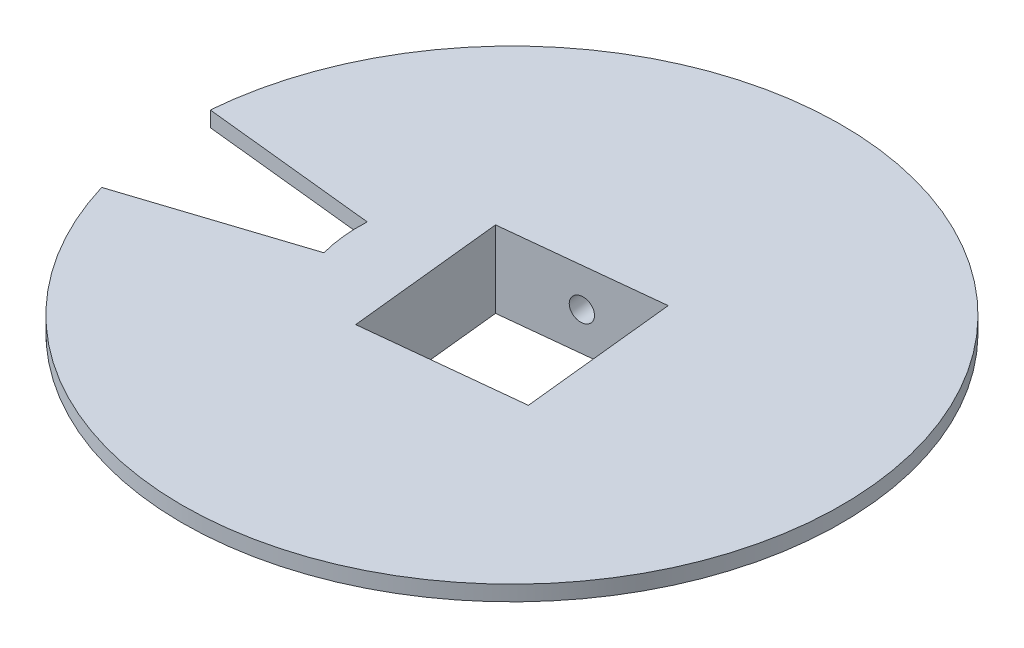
ISO-10303-21;
HEADER;
FILE_DESCRIPTION(('STEP AP214'),'2;1');
FILE_NAME('part.step','',(''),(''),'','','');
FILE_SCHEMA(('AUTOMOTIVE_DESIGN { 1 0 10303 214 1 1 1 1 }'));
ENDSEC;
DATA;
#1=APPLICATION_CONTEXT('core data for automotive mechanical design processes');
#2=APPLICATION_PROTOCOL_DEFINITION('international standard','automotive_design',2000,#1);
#3=PRODUCT_CONTEXT('',#1,'mechanical');
#4=PRODUCT('Part','Part','',(#3));
#5=PRODUCT_RELATED_PRODUCT_CATEGORY('part','',(#4));
#6=PRODUCT_DEFINITION_FORMATION('','',#4);
#7=PRODUCT_DEFINITION_CONTEXT('part definition',#1,'design');
#8=PRODUCT_DEFINITION('design','',#6,#7);
#9=PRODUCT_DEFINITION_SHAPE('','',#8);
#10=(LENGTH_UNIT() NAMED_UNIT(*) SI_UNIT(.MILLI.,.METRE.));
#11=(NAMED_UNIT(*) PLANE_ANGLE_UNIT() SI_UNIT($,.RADIAN.));
#12=(NAMED_UNIT(*) SI_UNIT($,.STERADIAN.) SOLID_ANGLE_UNIT());
#13=UNCERTAINTY_MEASURE_WITH_UNIT(LENGTH_MEASURE(1.E-05),#10,'distance_accuracy_value','');
#14=(GEOMETRIC_REPRESENTATION_CONTEXT(3) GLOBAL_UNCERTAINTY_ASSIGNED_CONTEXT((#13)) GLOBAL_UNIT_ASSIGNED_CONTEXT((#10,
#11,#12)) REPRESENTATION_CONTEXT('',''));
#15=CARTESIAN_POINT('',(0.,0.,0.));
#16=DIRECTION('',(0.,0.,1.));
#17=DIRECTION('',(1.,0.,0.));
#18=AXIS2_PLACEMENT_3D('',#15,#16,#17);
#19=CARTESIAN_POINT('',(0.,-4.,0.));
#20=DIRECTION('',(0.,-1.,0.));
#21=DIRECTION('',(1.,0.,0.));
#22=AXIS2_PLACEMENT_3D('',#19,#20,#21);
#23=PLANE('',#22);
#24=DIRECTION('',(-0.994521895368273,0.,-0.104528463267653));
#25=VECTOR('',#24,1.);
#26=CARTESIAN_POINT('',(-0.209056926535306,-4.00000000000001,1.98904379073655));
#27=LINE('',#26,#25);
#28=CARTESIAN_POINT('',(-39.9401755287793,-4.00000000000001,-2.18686504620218));
#29=VERTEX_POINT('',#28);
#30=CARTESIAN_POINT('',(-85.7148083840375,-4.00000000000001,-6.99797282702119));
#31=VERTEX_POINT('',#30);
#32=EDGE_CURVE('E149',#29,#31,#27,.T.);
#33=ORIENTED_EDGE('',*,*,#32,.T.);
#34=CARTESIAN_POINT('',(0.,-4.,0.));
#35=DIRECTION('',(0.,1.,0.));
#36=DIRECTION('',(-1.,0.,0.));
#37=AXIS2_PLACEMENT_3D('',#34,#35,#36);
#38=CIRCLE('',#37,86.);
#39=CARTESIAN_POINT('',(-82.3867738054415,-4.00000000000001,24.6661610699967));
#40=VERTEX_POINT('',#39);
#41=EDGE_CURVE('E168',#40,#31,#38,.T.);
#42=ORIENTED_EDGE('',*,*,#41,.F.);
#43=DIRECTION('',(-0.951056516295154,0.,0.309016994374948));
#44=VECTOR('',#43,1.);
#45=CARTESIAN_POINT('',(-0.618033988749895,-4.00000000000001,-1.90211303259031));
#46=LINE('',#45,#44);
#47=CARTESIAN_POINT('',(-38.6127120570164,-4.00000000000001,10.4431062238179));
#48=VERTEX_POINT('',#47);
#49=EDGE_CURVE('E152',#48,#40,#46,.T.);
#50=ORIENTED_EDGE('',*,*,#49,.F.);
#51=CARTESIAN_POINT('',(0.,-4.00000000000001,0.));
#52=DIRECTION('',(0.,1.,0.));
#53=DIRECTION('',(0.,0.,1.));
#54=AXIS2_PLACEMENT_3D('',#51,#52,#53);
#55=CIRCLE('',#54,40.);
#56=EDGE_CURVE('E163',#48,#29,#55,.T.);
#57=ORIENTED_EDGE('',*,*,#56,.T.);
#58=EDGE_LOOP('',(#33,#42,#50,#57));
#59=FACE_BOUND('',#58,.T.);
#60=ADVANCED_FACE('F34',(#59),#23,.T.);
#61=CARTESIAN_POINT('',(0.,0.,0.));
#62=DIRECTION('',(0.,1.,0.));
#63=DIRECTION('',(-1.,0.,0.));
#64=AXIS2_PLACEMENT_3D('',#61,#62,#63);
#65=CYLINDRICAL_SURFACE('',#64,86.);
#66=DIRECTION('',(0.,1.,0.));
#67=VECTOR('',#66,1.);
#68=CARTESIAN_POINT('',(-85.7148083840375,0.,-6.99797282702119));
#69=LINE('',#68,#67);
#70=CARTESIAN_POINT('',(-85.7148083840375,0.,-6.99797282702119));
#71=VERTEX_POINT('',#70);
#72=EDGE_CURVE('E161',#71,#31,#69,.F.);
#73=ORIENTED_EDGE('',*,*,#72,.F.);
#74=CARTESIAN_POINT('',(0.,0.,0.));
#75=DIRECTION('',(0.,1.,0.));
#76=DIRECTION('',(-1.,0.,0.));
#77=AXIS2_PLACEMENT_3D('',#74,#75,#76);
#78=CIRCLE('',#77,86.);
#79=CARTESIAN_POINT('',(-82.3867738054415,0.,24.6661610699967));
#80=VERTEX_POINT('',#79);
#81=EDGE_CURVE('E165',#80,#71,#78,.T.);
#82=ORIENTED_EDGE('',*,*,#81,.F.);
#83=DIRECTION('',(0.,1.,0.));
#84=VECTOR('',#83,1.);
#85=CARTESIAN_POINT('',(-82.3867738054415,0.,24.6661610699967));
#86=LINE('',#85,#84);
#87=EDGE_CURVE('E155',#80,#40,#86,.F.);
#88=ORIENTED_EDGE('',*,*,#87,.T.);
#89=ORIENTED_EDGE('',*,*,#41,.T.);
#90=EDGE_LOOP('',(#73,#82,#88,#89));
#91=FACE_BOUND('',#90,.T.);
#92=ADVANCED_FACE('F191',(#91),#65,.T.);
#93=CARTESIAN_POINT('',(0.,0.,0.));
#94=DIRECTION('',(0.,1.,0.));
#95=DIRECTION('',(-1.,0.,0.));
#96=AXIS2_PLACEMENT_3D('',#93,#94,#95);
#97=PLANE('',#96);
#98=DIRECTION('',(0.994521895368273,0.,-0.104528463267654));
#99=VECTOR('',#98,1.);
#100=CARTESIAN_POINT('',(2.14283349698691,0.,20.3876988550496));
#101=LINE('',#100,#99);
#102=CARTESIAN_POINT('',(-18.2448653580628,0.,22.5305323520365));
#103=VERTEX_POINT('',#102);
#104=CARTESIAN_POINT('',(22.5305323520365,0.,18.2448653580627));
#105=VERTEX_POINT('',#104);
#106=EDGE_CURVE('E49',#103,#105,#101,.T.);
#107=ORIENTED_EDGE('',*,*,#106,.F.);
#108=DIRECTION('',(0.104528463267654,0.,0.994521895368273));
#109=VECTOR('',#108,1.);
#110=CARTESIAN_POINT('',(-20.3876988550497,0.,2.14283349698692));
#111=LINE('',#110,#109);
#112=CARTESIAN_POINT('',(-22.5305323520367,0.,-18.2448653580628));
#113=VERTEX_POINT('',#112);
#114=EDGE_CURVE('E117',#113,#103,#111,.T.);
#115=ORIENTED_EDGE('',*,*,#114,.F.);
#116=DIRECTION('',(-0.994521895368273,0.,0.104528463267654));
#117=VECTOR('',#116,1.);
#118=CARTESIAN_POINT('',(-2.14283349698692,0.,-20.3876988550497));
#119=LINE('',#118,#117);
#120=CARTESIAN_POINT('',(18.2448653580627,0.,-22.5305323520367));
#121=VERTEX_POINT('',#120);
#122=EDGE_CURVE('E120',#121,#113,#119,.T.);
#123=ORIENTED_EDGE('',*,*,#122,.F.);
#124=DIRECTION('',(-0.104528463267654,0.,-0.994521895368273));
#125=VECTOR('',#124,1.);
#126=CARTESIAN_POINT('',(20.3876988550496,0.,-2.14283349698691));
#127=LINE('',#126,#125);
#128=EDGE_CURVE('E133',#105,#121,#127,.T.);
#129=ORIENTED_EDGE('',*,*,#128,.F.);
#130=EDGE_LOOP('',(#107,#115,#123,#129));
#131=FACE_BOUND('',#130,.T.);
#132=DIRECTION('',(-0.994521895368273,0.,-0.104528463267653));
#133=VECTOR('',#132,1.);
#134=CARTESIAN_POINT('',(-0.209056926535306,0.,1.98904379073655));
#135=LINE('',#134,#133);
#136=CARTESIAN_POINT('',(-39.9401755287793,0.,-2.18686504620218));
#137=VERTEX_POINT('',#136);
#138=EDGE_CURVE('E146',#137,#71,#135,.T.);
#139=ORIENTED_EDGE('',*,*,#138,.F.);
#140=CARTESIAN_POINT('',(0.,0.,0.));
#141=DIRECTION('',(0.,-1.,0.));
#142=DIRECTION('',(1.,0.,0.));
#143=AXIS2_PLACEMENT_3D('',#140,#141,#142);
#144=CIRCLE('',#143,40.);
#145=CARTESIAN_POINT('',(-38.6127120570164,0.,10.4431062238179));
#146=VERTEX_POINT('',#145);
#147=EDGE_CURVE('E139',#146,#137,#144,.T.);
#148=ORIENTED_EDGE('',*,*,#147,.F.);
#149=DIRECTION('',(-0.951056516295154,0.,0.309016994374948));
#150=VECTOR('',#149,1.);
#151=CARTESIAN_POINT('',(-0.618033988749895,0.,-1.90211303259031));
#152=LINE('',#151,#150);
#153=EDGE_CURVE('E153',#146,#80,#152,.T.);
#154=ORIENTED_EDGE('',*,*,#153,.T.);
#155=ORIENTED_EDGE('',*,*,#81,.T.);
#156=EDGE_LOOP('',(#139,#148,#154,#155));
#157=FACE_BOUND('',#156,.T.);
#158=ADVANCED_FACE('F188',(#131,#157),#97,.T.);
#159=CARTESIAN_POINT('',(-0.618033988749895,-4.00000000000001,-1.90211303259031));
#160=DIRECTION('',(-0.309016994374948,0.,-0.951056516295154));
#161=DIRECTION('',(-0.951056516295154,0.,0.309016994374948));
#162=AXIS2_PLACEMENT_3D('',#159,#160,#161);
#163=PLANE('',#162);
#164=ORIENTED_EDGE('',*,*,#153,.F.);
#165=DIRECTION('',(0.,1.,0.));
#166=VECTOR('',#165,1.);
#167=CARTESIAN_POINT('',(-38.6127120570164,-4.00000000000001,10.4431062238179));
#168=LINE('',#167,#166);
#169=EDGE_CURVE('E42',#146,#48,#168,.F.);
#170=ORIENTED_EDGE('',*,*,#169,.T.);
#171=ORIENTED_EDGE('',*,*,#49,.T.);
#172=ORIENTED_EDGE('',*,*,#87,.F.);
#173=EDGE_LOOP('',(#164,#170,#171,#172));
#174=FACE_BOUND('',#173,.T.);
#175=ADVANCED_FACE('F174',(#174),#163,.T.);
#176=CARTESIAN_POINT('',(-0.209056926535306,-4.00000000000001,1.98904379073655));
#177=DIRECTION('',(0.104528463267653,0.,-0.994521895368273));
#178=DIRECTION('',(-0.994521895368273,0.,-0.104528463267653));
#179=AXIS2_PLACEMENT_3D('',#176,#177,#178);
#180=PLANE('',#179);
#181=ORIENTED_EDGE('',*,*,#72,.T.);
#182=ORIENTED_EDGE('',*,*,#32,.F.);
#183=DIRECTION('',(0.,1.,0.));
#184=VECTOR('',#183,1.);
#185=CARTESIAN_POINT('',(-39.9401755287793,-4.00000000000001,-2.18686504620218));
#186=LINE('',#185,#184);
#187=EDGE_CURVE('E11',#137,#29,#186,.F.);
#188=ORIENTED_EDGE('',*,*,#187,.F.);
#189=ORIENTED_EDGE('',*,*,#138,.T.);
#190=EDGE_LOOP('',(#181,#182,#188,#189));
#191=FACE_BOUND('',#190,.T.);
#192=ADVANCED_FACE('F185',(#191),#180,.F.);
#193=CARTESIAN_POINT('',(0.,-20.,0.));
#194=DIRECTION('',(0.,1.,0.));
#195=DIRECTION('',(-1.,0.,0.));
#196=AXIS2_PLACEMENT_3D('',#193,#194,#195);
#197=CYLINDRICAL_SURFACE('',#196,40.);
#198=CARTESIAN_POINT('',(-1.18579680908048,-10.,-39.9824197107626));
#199=CARTESIAN_POINT('',(-1.18580429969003,-9.8317431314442,-39.9824204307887));
#200=CARTESIAN_POINT('',(-1.20003427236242,-9.6633702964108,-39.9820053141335));
#201=CARTESIAN_POINT('',(-1.25658390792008,-9.33127916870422,-39.980267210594));
#202=CARTESIAN_POINT('',(-1.29893577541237,-9.16756643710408,-39.9789431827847));
#203=CARTESIAN_POINT('',(-1.41047349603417,-8.84965363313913,-39.9751630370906));
#204=CARTESIAN_POINT('',(-1.47964459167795,-8.69544838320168,-39.9727075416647));
#205=CARTESIAN_POINT('',(-1.64278985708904,-8.40085498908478,-39.966334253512));
#206=CARTESIAN_POINT('',(-1.73675856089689,-8.2604638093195,-39.9624167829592));
#207=CARTESIAN_POINT('',(-1.94699418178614,-7.99714995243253,-39.95272549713));
#208=CARTESIAN_POINT('',(-2.06330232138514,-7.8742603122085,-39.9469482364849));
#209=CARTESIAN_POINT('',(-2.31477157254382,-7.64972135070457,-39.9331648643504));
#210=CARTESIAN_POINT('',(-2.4499334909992,-7.54807293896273,-39.9251586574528));
#211=CARTESIAN_POINT('',(-2.73541234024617,-7.36879489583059,-39.9066156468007));
#212=CARTESIAN_POINT('',(-2.8857467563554,-7.29119340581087,-39.8960759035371));
#213=CARTESIAN_POINT('',(-3.19713303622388,-7.1623920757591,-39.8723299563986));
#214=CARTESIAN_POINT('',(-3.35818474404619,-7.11119185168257,-39.8591237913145));
#215=CARTESIAN_POINT('',(-3.68607728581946,-7.03674032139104,-39.8301375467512));
#216=CARTESIAN_POINT('',(-3.85290655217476,-7.01343615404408,-39.8143623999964));
#217=CARTESIAN_POINT('',(-4.18787477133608,-6.99527491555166,-39.7805233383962));
#218=CARTESIAN_POINT('',(-4.35601370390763,-7.00041740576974,-39.7624594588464));
#219=CARTESIAN_POINT('',(-4.68847586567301,-7.03896012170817,-39.7246288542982));
#220=CARTESIAN_POINT('',(-4.85280608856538,-7.07230349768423,-39.7048656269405));
#221=CARTESIAN_POINT('',(-5.17336864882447,-7.16621316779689,-39.6643716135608));
#222=CARTESIAN_POINT('',(-5.32960092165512,-7.22677967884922,-39.6436408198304));
#223=CARTESIAN_POINT('',(-5.62975028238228,-7.37348016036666,-39.6021327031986));
#224=CARTESIAN_POINT('',(-5.77365485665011,-7.45963972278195,-39.5813553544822));
#225=CARTESIAN_POINT('',(-6.04497820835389,-7.65506196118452,-39.5408280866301));
#226=CARTESIAN_POINT('',(-6.17239671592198,-7.76432501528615,-39.5210781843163));
#227=CARTESIAN_POINT('',(-6.40751495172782,-8.00317335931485,-39.4836420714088));
#228=CARTESIAN_POINT('',(-6.5151653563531,-8.13280802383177,-39.4659610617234));
#229=CARTESIAN_POINT('',(-6.7073682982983,-8.40854727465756,-39.4337512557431));
#230=CARTESIAN_POINT('',(-6.7919208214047,-8.55465187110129,-39.4192224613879));
#231=CARTESIAN_POINT('',(-6.93557490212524,-8.85921700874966,-39.3942019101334));
#232=CARTESIAN_POINT('',(-6.9946741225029,-9.01767868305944,-39.3837105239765));
#233=CARTESIAN_POINT('',(-7.08574651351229,-9.34244416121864,-39.3674275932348));
#234=CARTESIAN_POINT('',(-7.11772014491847,-9.5087478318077,-39.3616359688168));
#235=CARTESIAN_POINT('',(-7.15359367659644,-9.84404315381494,-39.3551322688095));
#236=CARTESIAN_POINT('',(-7.15756172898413,-10.0130272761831,-39.3544078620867));
#237=CARTESIAN_POINT('',(-7.1374924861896,-10.349267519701,-39.3580525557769));
#238=CARTESIAN_POINT('',(-7.11345540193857,-10.5165236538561,-39.3624216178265));
#239=CARTESIAN_POINT('',(-7.03809874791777,-10.8443631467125,-39.3759649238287));
#240=CARTESIAN_POINT('',(-6.98681081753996,-11.0049540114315,-39.3851335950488));
#241=CARTESIAN_POINT('',(-6.85840739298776,-11.3151365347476,-39.4076956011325));
#242=CARTESIAN_POINT('',(-6.78129156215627,-11.4647280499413,-39.4210889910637));
#243=CARTESIAN_POINT('',(-6.60320177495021,-11.7489821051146,-39.4513100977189));
#244=CARTESIAN_POINT('',(-6.50218211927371,-11.883615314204,-39.4681443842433));
#245=CARTESIAN_POINT('',(-6.27916364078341,-12.1338349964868,-39.5042381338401));
#246=CARTESIAN_POINT('',(-6.15716452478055,-12.2494212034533,-39.523497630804));
#247=CARTESIAN_POINT('',(-5.89529910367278,-12.4585005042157,-39.5634047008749));
#248=CARTESIAN_POINT('',(-5.75539743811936,-12.5519488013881,-39.5840549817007));
#249=CARTESIAN_POINT('',(-5.4618209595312,-12.7137926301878,-39.6256288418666));
#250=CARTESIAN_POINT('',(-5.30814626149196,-12.7821883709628,-39.6465524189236));
#251=CARTESIAN_POINT('',(-4.99150511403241,-12.89190821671,-39.6876595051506));
#252=CARTESIAN_POINT('',(-4.82854845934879,-12.9332603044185,-39.7078437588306));
#253=CARTESIAN_POINT('',(-4.49781051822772,-12.9878105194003,-39.7466654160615));
#254=CARTESIAN_POINT('',(-4.33002930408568,-13.0010090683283,-39.7653028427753));
#255=CARTESIAN_POINT('',(-3.99483605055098,-12.9988730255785,-39.8003720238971));
#256=CARTESIAN_POINT('',(-3.82742411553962,-12.9836083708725,-39.8168090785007));
#257=CARTESIAN_POINT('',(-3.49732177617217,-12.925124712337,-39.8471608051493));
#258=CARTESIAN_POINT('',(-3.33463137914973,-12.8819056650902,-39.8610754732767));
#259=CARTESIAN_POINT('',(-3.01861115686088,-12.7687570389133,-39.886252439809));
#260=CARTESIAN_POINT('',(-2.86528102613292,-12.6988283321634,-39.8975148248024));
#261=CARTESIAN_POINT('',(-2.57233838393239,-12.5342539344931,-39.9174730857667));
#262=CARTESIAN_POINT('',(-2.43272559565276,-12.4396087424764,-39.9261690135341));
#263=CARTESIAN_POINT('',(-2.17087597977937,-12.2280263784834,-39.9412639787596));
#264=CARTESIAN_POINT('',(-2.04868038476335,-12.1110377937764,-39.9476576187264));
#265=CARTESIAN_POINT('',(-1.82552545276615,-11.858175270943,-39.9584781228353));
#266=CARTESIAN_POINT('',(-1.72457128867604,-11.7222967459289,-39.9629045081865));
#267=CARTESIAN_POINT('',(-1.54670970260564,-11.435295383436,-39.9701845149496));
#268=CARTESIAN_POINT('',(-1.46984089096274,-11.2841485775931,-39.9730356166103));
#269=CARTESIAN_POINT('',(-1.34268429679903,-10.9711815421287,-39.9775097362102));
#270=CARTESIAN_POINT('',(-1.29236570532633,-10.8093739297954,-39.9791341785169));
#271=CARTESIAN_POINT('',(-1.23270114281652,-10.5388300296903,-39.9810074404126));
#272=CARTESIAN_POINT('',(-1.21513556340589,-10.4318377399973,-39.9815405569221));
#273=CARTESIAN_POINT('',(-1.19168099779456,-10.2165796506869,-39.9822464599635));
#274=CARTESIAN_POINT('',(-1.1857919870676,-10.1083138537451,-39.9824192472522));
#275=CARTESIAN_POINT('',(-1.18579680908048,-10.,-39.9824197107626));
#276=B_SPLINE_CURVE_WITH_KNOTS('',3,(#198,#199,#200,#201,#202,#203,#204,#205,#206,#207,#208,
#209,#210,#211,#212,#213,#214,#215,#216,#217,#218,#219,#220,#221,#222,#223,#224,#225,#226,#227,
#228,#229,#230,#231,#232,#233,#234,#235,#236,#237,#238,#239,#240,#241,#242,#243,#244,#245,#246,
#247,#248,#249,#250,#251,#252,#253,#254,#255,#256,#257,#258,#259,#260,#261,#262,#263,#264,#265,
#266,#267,#268,#269,#270,#271,#272,#273,#274,#275),.UNSPECIFIED.,.T.,.F.,(4,2,2,2,2,2,2,2,2,2,2,
2,2,2,2,2,2,2,2,2,2,2,2,2,2,2,2,2,2,2,2,2,2,2,2,2,2,2,4),(0.,0.504375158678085,1.00932891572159,
1.51400521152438,2.01857035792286,2.52407567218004,3.0296026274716,3.53571897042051,
4.04182795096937,4.54697636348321,5.05211698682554,5.55624172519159,6.06037048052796,
6.5650050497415,7.06964787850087,7.57553322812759,8.08141888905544,8.58735099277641,
9.09327450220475,9.59796641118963,10.1026545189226,10.6067579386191,11.110867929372,
11.6159495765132,12.1210382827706,12.6271404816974,13.1332384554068,13.638811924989,
14.1443778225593,14.6487031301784,15.1530292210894,15.6573388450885,16.1616382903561,
16.6671124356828,17.1727095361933,17.6791130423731,18.1849276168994,18.5096152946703,
18.8343022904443),.UNSPECIFIED.);
#277=CARTESIAN_POINT('',(-1.18579680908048,-10.,-39.9824197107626));
#278=VERTEX_POINT('',#277);
#279=EDGE_CURVE('E123',#278,#278,#276,.T.);
#280=ORIENTED_EDGE('',*,*,#279,.T.);
#281=EDGE_LOOP('',(#280));
#282=FACE_BOUND('',#281,.T.);
#283=CARTESIAN_POINT('',(7.15292818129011,-10.,39.3552489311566));
#284=CARTESIAN_POINT('',(7.1529210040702,-10.1682568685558,39.3552511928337));
#285=CARTESIAN_POINT('',(7.13891568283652,-10.3366297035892,39.357803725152));
#286=CARTESIAN_POINT('',(7.08324042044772,-10.6687208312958,39.367860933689));
#287=CARTESIAN_POINT('',(7.04153876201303,-10.8324335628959,39.3753712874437));
#288=CARTESIAN_POINT('',(6.93165247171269,-11.1503463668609,39.394863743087));
#289=CARTESIAN_POINT('',(6.8634824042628,-11.3045516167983,39.4068433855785));
#290=CARTESIAN_POINT('',(6.70257717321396,-11.5991450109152,39.4345291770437));
#291=CARTESIAN_POINT('',(6.6098474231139,-11.7395361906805,39.4502345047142));
#292=CARTESIAN_POINT('',(6.40219102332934,-12.0028500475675,39.4844654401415));
#293=CARTESIAN_POINT('',(6.28722333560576,-12.1257396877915,39.5029962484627));
#294=CARTESIAN_POINT('',(6.0383835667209,-12.3502786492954,39.5417974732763));
#295=CARTESIAN_POINT('',(5.90451067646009,-12.4519270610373,39.5620679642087));
#296=CARTESIAN_POINT('',(5.62141491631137,-12.6312051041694,39.6032845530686));
#297=CARTESIAN_POINT('',(5.4721743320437,-12.7088065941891,39.6242314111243));
#298=CARTESIAN_POINT('',(5.16265552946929,-12.8376079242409,39.6657452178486));
#299=CARTESIAN_POINT('',(5.00237747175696,-12.8888081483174,39.6863121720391));
#300=CARTESIAN_POINT('',(4.67562358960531,-12.963259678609,39.7261320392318));
#301=CARTESIAN_POINT('',(4.509160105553,-12.9865638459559,39.7453873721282));
#302=CARTESIAN_POINT('',(4.1744762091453,-13.0047250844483,39.7819315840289));
#303=CARTESIAN_POINT('',(4.00625582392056,-12.9995825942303,39.7992204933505));
#304=CARTESIAN_POINT('',(3.67319333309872,-12.9610398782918,39.8313393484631));
#305=CARTESIAN_POINT('',(3.50834511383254,-12.9276965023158,39.8461741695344));
#306=CARTESIAN_POINT('',(3.18636843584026,-12.8337868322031,39.8732137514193));
#307=CARTESIAN_POINT('',(3.02924003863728,-12.7732203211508,39.8854184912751));
#308=CARTESIAN_POINT('',(2.72701963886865,-12.6265198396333,39.9072219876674));
#309=CARTESIAN_POINT('',(2.58193987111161,-12.540360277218,39.9168181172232));
#310=CARTESIAN_POINT('',(2.30811949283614,-12.3449380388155,39.9335877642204));
#311=CARTESIAN_POINT('',(2.17937914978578,-12.2356749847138,39.9407612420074));
#312=CARTESIAN_POINT('',(1.94161540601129,-11.9968266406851,39.9530270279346));
#313=CARTESIAN_POINT('',(1.83264133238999,-11.8671919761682,39.9581141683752));
#314=CARTESIAN_POINT('',(1.63794169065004,-11.5914527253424,39.9665694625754));
#315=CARTESIAN_POINT('',(1.55221613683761,-11.4453481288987,39.9699376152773));
#316=CARTESIAN_POINT('',(1.40649917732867,-11.1407829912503,39.9753311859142));
#317=CARTESIAN_POINT('',(1.34651013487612,-10.9823213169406,39.9773564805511));
#318=CARTESIAN_POINT('',(1.25404248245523,-10.6575558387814,39.9803643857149));
#319=CARTESIAN_POINT('',(1.22156340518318,-10.4912521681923,39.9813470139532));
#320=CARTESIAN_POINT('',(1.18512160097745,-10.1559568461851,39.982443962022));
#321=CARTESIAN_POINT('',(1.18108964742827,-9.98697272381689,39.9825603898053));
#322=CARTESIAN_POINT('',(1.20147810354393,-9.650732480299,39.9819528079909));
#323=CARTESIAN_POINT('',(1.22589829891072,-9.48347634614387,39.9812288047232));
#324=CARTESIAN_POINT('',(1.30242404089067,-9.15563685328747,39.9788086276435));
#325=CARTESIAN_POINT('',(1.35449748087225,-8.99504598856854,39.9771135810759));
#326=CARTESIAN_POINT('',(1.4847858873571,-8.68486346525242,39.972485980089));
#327=CARTESIAN_POINT('',(1.56300119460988,-8.53527195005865,39.9695534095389));
#328=CARTESIAN_POINT('',(1.74348261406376,-8.2510178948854,39.9620871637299));
#329=CARTESIAN_POINT('',(1.84579479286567,-8.11638468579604,39.9575504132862));
#330=CARTESIAN_POINT('',(2.07144409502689,-7.86616500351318,39.9464872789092));
#331=CARTESIAN_POINT('',(2.19478151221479,-7.75057879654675,39.9399608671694));
#332=CARTESIAN_POINT('',(2.45922169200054,-7.54149949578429,39.9245509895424));
#333=CARTESIAN_POINT('',(2.60035960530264,-7.44805119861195,39.9156628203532));
#334=CARTESIAN_POINT('',(2.89616442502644,-7.28620736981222,39.8952902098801));
#335=CARTESIAN_POINT('',(3.05083121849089,-7.21781162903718,39.8838057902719));
#336=CARTESIAN_POINT('',(3.36909964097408,-7.10809178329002,39.8581811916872));
#337=CARTESIAN_POINT('',(3.53269184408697,-7.06673969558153,39.8440437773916));
#338=CARTESIAN_POINT('',(3.86427384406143,-7.01218948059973,39.8132528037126));
#339=CARTESIAN_POINT('',(4.03226357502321,-6.9989909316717,39.7965992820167));
#340=CARTESIAN_POINT('',(4.36742334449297,-7.00112697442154,39.7612115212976));
#341=CARTESIAN_POINT('',(4.53459438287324,-7.01639162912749,39.74248248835));
#342=CARTESIAN_POINT('',(4.86379367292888,-7.074875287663,39.7035388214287));
#343=CARTESIAN_POINT('',(5.02582191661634,-7.11809433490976,39.6833241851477));
#344=CARTESIAN_POINT('',(5.34017092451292,-7.23124296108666,39.6422466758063));
#345=CARTESIAN_POINT('',(5.49249200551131,-7.30117166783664,39.6213838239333));
#346=CARTESIAN_POINT('',(5.78318270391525,-7.46574606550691,39.5799997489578));
#347=CARTESIAN_POINT('',(5.92155260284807,-7.56039125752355,39.5594785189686));
#348=CARTESIAN_POINT('',(6.18081859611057,-7.77197362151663,39.5198020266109));
#349=CARTESIAN_POINT('',(6.30167323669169,-7.88896220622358,39.500650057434));
#350=CARTESIAN_POINT('',(6.52220140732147,-8.14182472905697,39.4648375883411));
#351=CARTESIAN_POINT('',(6.62186977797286,-8.27770325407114,39.4481776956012));
#352=CARTESIAN_POINT('',(6.79735826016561,-8.56470461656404,39.4183191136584));
#353=CARTESIAN_POINT('',(6.87314008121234,-8.71585142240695,39.4051259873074));
#354=CARTESIAN_POINT('',(6.99844822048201,-9.02881845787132,39.3830649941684));
#355=CARTESIAN_POINT('',(7.04800497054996,-9.19062607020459,39.3741921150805));
#356=CARTESIAN_POINT('',(7.10675519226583,-9.4611699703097,39.363619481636));
#357=CARTESIAN_POINT('',(7.12404776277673,-9.56816226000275,39.3604888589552));
#358=CARTESIAN_POINT('',(7.14713655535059,-9.78342034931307,39.3563028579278));
#359=CARTESIAN_POINT('',(7.15293280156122,-9.8916861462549,39.3552474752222));
#360=CARTESIAN_POINT('',(7.15292818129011,-10.,39.3552489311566));
#361=B_SPLINE_CURVE_WITH_KNOTS('',3,(#283,#284,#285,#286,#287,#288,#289,#290,#291,#292,#293,
#294,#295,#296,#297,#298,#299,#300,#301,#302,#303,#304,#305,#306,#307,#308,#309,#310,#311,#312,
#313,#314,#315,#316,#317,#318,#319,#320,#321,#322,#323,#324,#325,#326,#327,#328,#329,#330,#331,
#332,#333,#334,#335,#336,#337,#338,#339,#340,#341,#342,#343,#344,#345,#346,#347,#348,#349,#350,
#351,#352,#353,#354,#355,#356,#357,#358,#359,#360),.UNSPECIFIED.,.T.,.F.,(4,2,2,2,2,2,2,2,2,2,2,
2,2,2,2,2,2,2,2,2,2,2,2,2,2,2,2,2,2,2,2,2,2,2,2,2,2,2,4),(0.,0.504375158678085,1.00932891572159,
1.51400521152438,2.01857035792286,2.52407567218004,3.0296026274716,3.53571897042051,
4.04182795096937,4.54697636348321,5.05211698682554,5.55624172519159,6.06037048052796,
6.56500504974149,7.06964787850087,7.57553322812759,8.08141888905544,8.58735099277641,
9.09327450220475,9.59796641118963,10.1026545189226,10.6067579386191,11.110867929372,
11.6159495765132,12.1210382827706,12.6271404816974,13.1332384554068,13.638811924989,
14.1443778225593,14.6487031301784,15.1530292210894,15.6573388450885,16.1616382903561,
16.6671124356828,17.1727095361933,17.6791130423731,18.1849276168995,18.5096152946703,
18.8343022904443),.UNSPECIFIED.);
#362=CARTESIAN_POINT('',(7.15292818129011,-10.,39.3552489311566));
#363=VERTEX_POINT('',#362);
#364=EDGE_CURVE('E209',#363,#363,#361,.T.);
#365=ORIENTED_EDGE('',*,*,#364,.T.);
#366=EDGE_LOOP('',(#365));
#367=FACE_BOUND('',#366,.T.);
#368=ORIENTED_EDGE('',*,*,#169,.F.);
#369=ORIENTED_EDGE('',*,*,#147,.T.);
#370=ORIENTED_EDGE('',*,*,#187,.T.);
#371=ORIENTED_EDGE('',*,*,#56,.F.);
#372=EDGE_LOOP('',(#368,#369,#370,#371));
#373=FACE_BOUND('',#372,.T.);
#374=CARTESIAN_POINT('',(0.,-20.,0.));
#375=DIRECTION('',(0.,-1.,0.));
#376=DIRECTION('',(1.,0.,0.));
#377=AXIS2_PLACEMENT_3D('',#374,#375,#376);
#378=CIRCLE('',#377,40.);
#379=CARTESIAN_POINT('',(40.,-20.,0.));
#380=VERTEX_POINT('',#379);
#381=EDGE_CURVE('E143',#380,#380,#378,.T.);
#382=ORIENTED_EDGE('',*,*,#381,.F.);
#383=EDGE_LOOP('',(#382));
#384=FACE_BOUND('',#383,.T.);
#385=ADVANCED_FACE('F181',(#282,#367,#373,#384),#197,.T.);
#386=CARTESIAN_POINT('',(0.,-20.,0.));
#387=DIRECTION('',(0.,-1.,0.));
#388=DIRECTION('',(1.,0.,0.));
#389=AXIS2_PLACEMENT_3D('',#386,#387,#388);
#390=PLANE('',#389);
#391=DIRECTION('',(0.994521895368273,0.,-0.104528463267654));
#392=VECTOR('',#391,1.);
#393=CARTESIAN_POINT('',(2.14283349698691,-20.,20.3876988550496));
#394=LINE('',#393,#392);
#395=CARTESIAN_POINT('',(-18.2448653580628,-20.,22.5305323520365));
#396=VERTEX_POINT('',#395);
#397=CARTESIAN_POINT('',(22.5305323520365,-20.,18.2448653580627));
#398=VERTEX_POINT('',#397);
#399=EDGE_CURVE('E101',#396,#398,#394,.T.);
#400=ORIENTED_EDGE('',*,*,#399,.T.);
#401=DIRECTION('',(-0.104528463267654,0.,-0.994521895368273));
#402=VECTOR('',#401,1.);
#403=CARTESIAN_POINT('',(20.3876988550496,-20.,-2.14283349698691));
#404=LINE('',#403,#402);
#405=CARTESIAN_POINT('',(18.2448653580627,-20.,-22.5305323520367));
#406=VERTEX_POINT('',#405);
#407=EDGE_CURVE('E110',#398,#406,#404,.T.);
#408=ORIENTED_EDGE('',*,*,#407,.T.);
#409=DIRECTION('',(-0.994521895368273,0.,0.104528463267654));
#410=VECTOR('',#409,1.);
#411=CARTESIAN_POINT('',(-2.14283349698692,-20.,-20.3876988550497));
#412=LINE('',#411,#410);
#413=CARTESIAN_POINT('',(-22.5305323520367,-20.,-18.2448653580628));
#414=VERTEX_POINT('',#413);
#415=EDGE_CURVE('E57',#406,#414,#412,.T.);
#416=ORIENTED_EDGE('',*,*,#415,.T.);
#417=DIRECTION('',(0.104528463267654,0.,0.994521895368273));
#418=VECTOR('',#417,1.);
#419=CARTESIAN_POINT('',(-20.3876988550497,-20.,2.14283349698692));
#420=LINE('',#419,#418);
#421=EDGE_CURVE('E107',#414,#396,#420,.T.);
#422=ORIENTED_EDGE('',*,*,#421,.T.);
#423=EDGE_LOOP('',(#400,#408,#416,#422));
#424=FACE_BOUND('',#423,.T.);
#425=ORIENTED_EDGE('',*,*,#381,.T.);
#426=EDGE_LOOP('',(#425));
#427=FACE_BOUND('',#426,.T.);
#428=ADVANCED_FACE('F114',(#424,#427),#390,.T.);
#429=CARTESIAN_POINT('',(2.14283349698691,-20.,20.3876988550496));
#430=DIRECTION('',(0.104528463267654,0.,0.994521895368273));
#431=DIRECTION('',(0.994521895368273,0.,-0.104528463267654));
#432=AXIS2_PLACEMENT_3D('',#429,#430,#431);
#433=PLANE('',#432);
#434=CARTESIAN_POINT('',(2.1428334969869,-10.,20.3876988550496));
#435=DIRECTION('',(0.104528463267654,0.,0.994521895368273));
#436=DIRECTION('',(0.994521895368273,0.,-0.104528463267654));
#437=AXIS2_PLACEMENT_3D('',#434,#435,#436);
#438=CIRCLE('',#437,3.);
#439=CARTESIAN_POINT('',(5.12639918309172,-10.,20.0741134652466));
#440=VERTEX_POINT('',#439);
#441=EDGE_CURVE('E214',#440,#440,#438,.T.);
#442=ORIENTED_EDGE('',*,*,#441,.T.);
#443=EDGE_LOOP('',(#442));
#444=FACE_BOUND('',#443,.T.);
#445=ORIENTED_EDGE('',*,*,#106,.T.);
#446=DIRECTION('',(0.,1.,0.));
#447=VECTOR('',#446,1.);
#448=CARTESIAN_POINT('',(22.5305323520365,-20.,18.2448653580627));
#449=LINE('',#448,#447);
#450=EDGE_CURVE('E97',#398,#105,#449,.T.);
#451=ORIENTED_EDGE('',*,*,#450,.F.);
#452=ORIENTED_EDGE('',*,*,#399,.F.);
#453=DIRECTION('',(0.,1.,0.));
#454=VECTOR('',#453,1.);
#455=CARTESIAN_POINT('',(-18.2448653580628,-20.,22.5305323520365));
#456=LINE('',#455,#454);
#457=EDGE_CURVE('E137',#396,#103,#456,.T.);
#458=ORIENTED_EDGE('',*,*,#457,.T.);
#459=EDGE_LOOP('',(#445,#451,#452,#458));
#460=FACE_BOUND('',#459,.T.);
#461=ADVANCED_FACE('F99',(#444,#460),#433,.F.);
#462=CARTESIAN_POINT('',(-20.3876988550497,-20.,2.14283349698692));
#463=DIRECTION('',(-0.994521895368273,0.,0.104528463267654));
#464=DIRECTION('',(0.104528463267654,0.,0.994521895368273));
#465=AXIS2_PLACEMENT_3D('',#462,#463,#464);
#466=PLANE('',#465);
#467=ORIENTED_EDGE('',*,*,#114,.T.);
#468=ORIENTED_EDGE('',*,*,#457,.F.);
#469=ORIENTED_EDGE('',*,*,#421,.F.);
#470=DIRECTION('',(0.,1.,0.));
#471=VECTOR('',#470,1.);
#472=CARTESIAN_POINT('',(-22.5305323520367,-20.,-18.2448653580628));
#473=LINE('',#472,#471);
#474=EDGE_CURVE('E140',#414,#113,#473,.T.);
#475=ORIENTED_EDGE('',*,*,#474,.T.);
#476=EDGE_LOOP('',(#467,#468,#469,#475));
#477=FACE_BOUND('',#476,.T.);
#478=ADVANCED_FACE('F221',(#477),#466,.F.);
#479=CARTESIAN_POINT('',(-2.14283349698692,-20.,-20.3876988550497));
#480=DIRECTION('',(-0.104528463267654,0.,-0.994521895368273));
#481=DIRECTION('',(-0.994521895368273,0.,0.104528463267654));
#482=AXIS2_PLACEMENT_3D('',#479,#480,#481);
#483=PLANE('',#482);
#484=CARTESIAN_POINT('',(-2.14283349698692,-10.,-20.3876988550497));
#485=DIRECTION('',(-0.104528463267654,0.,-0.994521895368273));
#486=DIRECTION('',(-0.994521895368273,0.,0.104528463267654));
#487=AXIS2_PLACEMENT_3D('',#484,#485,#486);
#488=CIRCLE('',#487,3.);
#489=CARTESIAN_POINT('',(-5.12639918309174,-10.,-20.0741134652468));
#490=VERTEX_POINT('',#489);
#491=EDGE_CURVE('E37',#490,#490,#488,.T.);
#492=ORIENTED_EDGE('',*,*,#491,.T.);
#493=EDGE_LOOP('',(#492));
#494=FACE_BOUND('',#493,.T.);
#495=ORIENTED_EDGE('',*,*,#122,.T.);
#496=ORIENTED_EDGE('',*,*,#474,.F.);
#497=ORIENTED_EDGE('',*,*,#415,.F.);
#498=DIRECTION('',(0.,1.,0.));
#499=VECTOR('',#498,1.);
#500=CARTESIAN_POINT('',(18.2448653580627,-20.,-22.5305323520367));
#501=LINE('',#500,#499);
#502=EDGE_CURVE('E106',#406,#121,#501,.T.);
#503=ORIENTED_EDGE('',*,*,#502,.T.);
#504=EDGE_LOOP('',(#495,#496,#497,#503));
#505=FACE_BOUND('',#504,.T.);
#506=ADVANCED_FACE('F225',(#494,#505),#483,.F.);
#507=CARTESIAN_POINT('',(20.3876988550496,-20.,-2.14283349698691));
#508=DIRECTION('',(0.994521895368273,0.,-0.104528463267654));
#509=DIRECTION('',(-0.104528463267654,0.,-0.994521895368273));
#510=AXIS2_PLACEMENT_3D('',#507,#508,#509);
#511=PLANE('',#510);
#512=ORIENTED_EDGE('',*,*,#128,.T.);
#513=ORIENTED_EDGE('',*,*,#502,.F.);
#514=ORIENTED_EDGE('',*,*,#407,.F.);
#515=ORIENTED_EDGE('',*,*,#450,.T.);
#516=EDGE_LOOP('',(#512,#513,#514,#515));
#517=FACE_BOUND('',#516,.T.);
#518=ADVANCED_FACE('F111',(#517),#511,.F.);
#519=CARTESIAN_POINT('',(-9.87673981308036,-10.,-93.9709022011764));
#520=DIRECTION('',(0.104528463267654,0.,0.994521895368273));
#521=DIRECTION('',(0.994521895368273,0.,-0.104528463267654));
#522=AXIS2_PLACEMENT_3D('',#519,#520,#521);
#523=CYLINDRICAL_SURFACE('',#522,3.);
#524=ORIENTED_EDGE('',*,*,#491,.F.);
#525=EDGE_LOOP('',(#524));
#526=FACE_BOUND('',#525,.T.);
#527=ORIENTED_EDGE('',*,*,#279,.F.);
#528=EDGE_LOOP('',(#527));
#529=FACE_BOUND('',#528,.T.);
#530=ADVANCED_FACE('F215',(#526,#529),#523,.F.);
#531=ORIENTED_EDGE('',*,*,#441,.F.);
#532=EDGE_LOOP('',(#531));
#533=FACE_BOUND('',#532,.T.);
#534=ORIENTED_EDGE('',*,*,#364,.F.);
#535=EDGE_LOOP('',(#534));
#536=FACE_BOUND('',#535,.T.);
#537=ADVANCED_FACE('F219',(#533,#536),#523,.F.);
#538=CLOSED_SHELL('',(#60,#92,#158,#175,#192,#385,#428,#461,#478,#506,#518,#530,#537));
#539=MANIFOLD_SOLID_BREP('B2',#538);
#540=ADVANCED_BREP_SHAPE_REPRESENTATION('',(#18,#539),#14);
#541=SHAPE_DEFINITION_REPRESENTATION(#9,#540);
ENDSEC;
END-ISO-10303-21;
